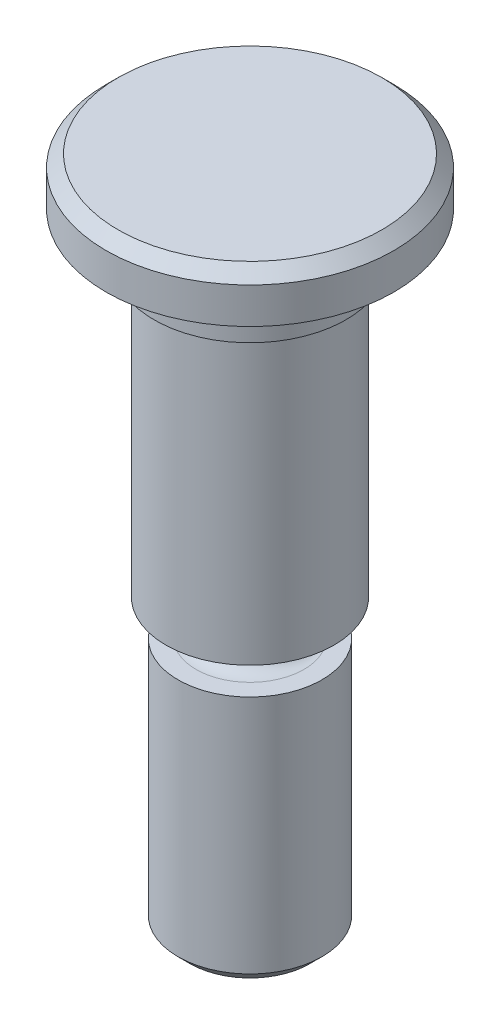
from build123d import *

# Parameters (mm, degrees)
CHANFREIN1_SIZE = 0.5


with BuildPart() as part:
    # Esquisse1 → Base-R_volution (revolve)
    with BuildSketch(Plane.XY, mode=Mode.PRIVATE) as base_r_volution_sk:
        Polygon((0, 28), (6, 28), (6, 26), (4, 26), (4, 24), (3.5, 24), (3.5, 12), (3, 12), (3, 0), (0, 0), align=None)
    revolve(base_r_volution_sk.sketch.rotate(Axis((0, 0, 0), (0, 1, 0)), 90), axis=Axis((0, 0, 0), (0, 1, 0)))

    # Chanfrein1
    chanfrein1_edges = [part.edges().sort_by_distance(p)[0] for p in [
        (0, 28, 6),
        (0, 0, 3),
    ]]
    chamfer(chanfrein1_edges, length=CHANFREIN1_SIZE)

    # Esquisse3 → Enlever de la mati_re-R_volution1 (revolve, cut)
    with BuildSketch(Plane(origin=(0, 0, 0), x_dir=(0, 0, -1), z_dir=(1, 0, 0))):
        with BuildLine():
            Line((2.25, 12), (3, 12))
            Line((3, 12), (3, 10.5))
            Line((3, 10.5), (2.25, 10.5))
            ThreePointArc((2.25, 10.5), (1.5, 11.25), (2.25, 12))
        make_face()
    revolve(axis=Axis((0, 0, 0), (0, 1, 0)), mode=Mode.SUBTRACT)


solid = part.part
